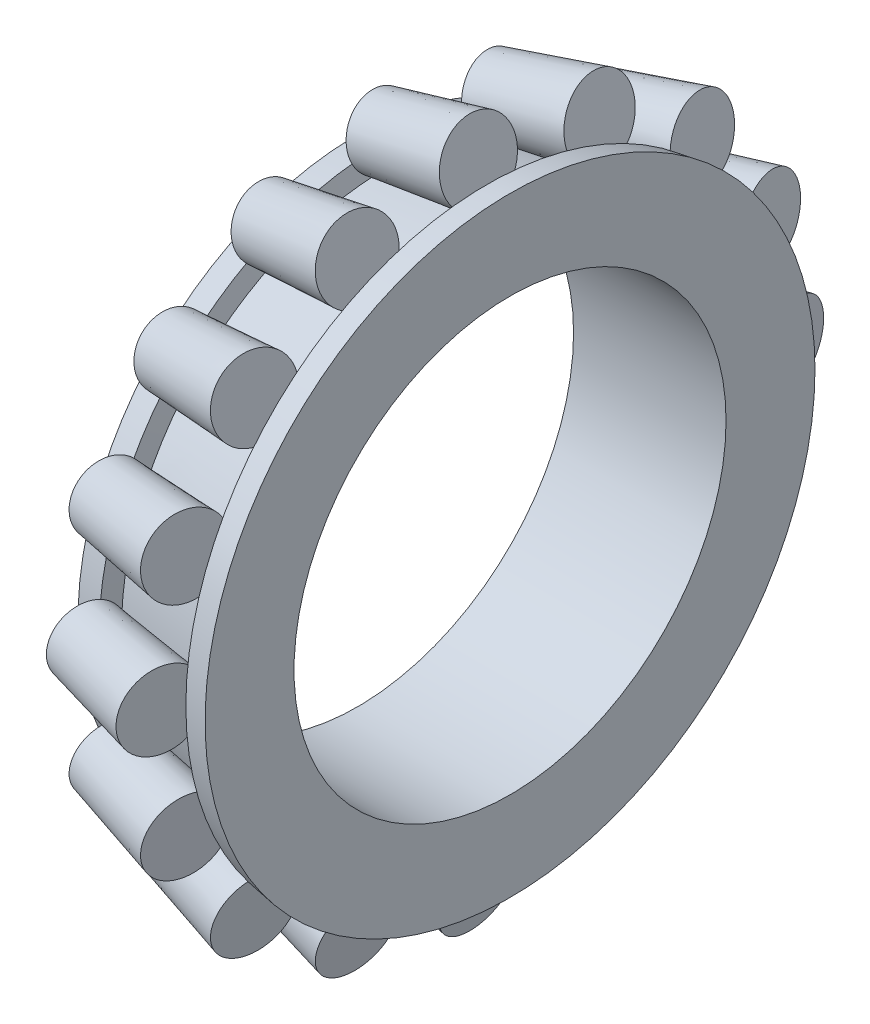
from build123d import *

# Parameters (mm, degrees)
R_P_TITION_CIRCULAIRE1_COUNT = 16


with BuildPart() as part:
    # Esquisse1 → Base-R_volution (revolve)
    with BuildSketch(Plane.XY, mode=Mode.PRIVATE) as base_r_volution_sk:
        Polygon((0, 17), (0, 24), (-1.815493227, 23.697417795), (-1.815493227, 22.176727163), (-9.706644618, 20.861535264), (-10.027212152, 22.328797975), (-12, 22), (-12, 17), align=None)
    revolve(base_r_volution_sk.sketch.rotate(Axis((40, 0, 0), (-1, 0, 0)), 90), axis=Axis((40, 0, 0), (-1, 0, 0)))

    # Esquisse2 → Boss.-R_vol.3 (revolve)
    with BuildSketch(Plane.XY):
        Polygon((-1.815493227, 22), (-9.649504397, 20.6), (-10.234718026, 23.135999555), (-2.490053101, 24.92317789), align=None)
    boss_r_vol_3 = revolve(axis=Axis((-2.490053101, 24.92317789, 0), (-0.9743926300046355, -0.2248532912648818, 0)))

    # R_p_tition circulaire1: Boss.-R_vol.3 ×16 about axis
    r_p_tition_circulaire1_axis = Axis((-10, 0, 0), (1, 0, 0))
    for i in range(1, R_P_TITION_CIRCULAIRE1_COUNT):
        add(boss_r_vol_3.rotate(r_p_tition_circulaire1_axis, i * 360 / R_P_TITION_CIRCULAIRE1_COUNT))


solid = part.part
